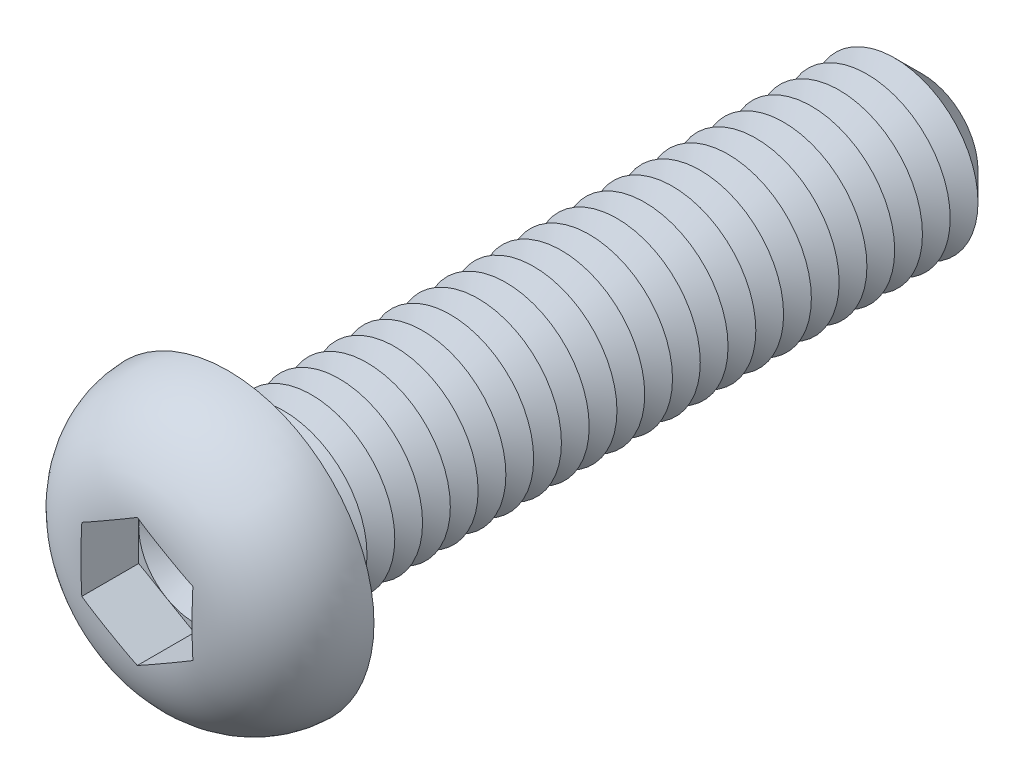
from build123d import *

# Parameters (mm, degrees)
CUT_EXTRUDE1_DEPTH  = 2.08
SKETCH4_R           = 3
BOSS_EXTRUDE1_DEPTH = 25
CHAMFER1_SIZE       = 1
LPATTERN1_COUNT     = 23
LPATTERN1_PITCH     = 1
FILLET2_R           = 0.5


with BuildPart() as part:
    # Sketch2 → Revolve1 (revolve)
    with BuildSketch(Plane(origin=(0, 0, 0), x_dir=(0, 0, -1), z_dir=(1, 0, 0)), mode=Mode.PRIVATE) as revolve1_sk:
        with BuildLine():
            Line((0, 0), (-3.3, 0))
            Line((-3.3, 0), (-3.3, 1.851470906))
            ThreePointArc((-3.3, 1.851470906), (-2.339262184, 4.220014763), (0, 5.25))
            Line((0, 5.25), (0, 0))
        make_face()
    revolve(revolve1_sk.sketch.rotate(Axis((0, 0, 47.934239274), (0, 0, -1)), 90), axis=Axis((0, 0, 47.934239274), (0, 0, -1)))

    # Sketch3 → Cut-Extrude1 (cut)
    with BuildSketch(Plane.XY.offset(3.3)):
        Polygon((0, 2.309401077), (-2, 1.154700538), (-2, -1.154700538), (0, -2.309401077), (2, -1.154700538), (2, 1.154700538), align=None)
    extrude(amount=-CUT_EXTRUDE1_DEPTH, mode=Mode.SUBTRACT)

    # Sketch4 → Boss-Extrude1 (add)
    with BuildSketch(Plane(origin=(0, 0, 0), x_dir=(-1, 0, 0), z_dir=(0, 0, -1))):
        Circle(SKETCH4_R)
    extrude(amount=BOSS_EXTRUDE1_DEPTH)

    # Chamfer1
    chamfer1_edges = [part.edges().sort_by_distance(p)[0] for p in [
        (3, 0, -25),
    ]]
    chamfer(chamfer1_edges, length=CHAMFER1_SIZE)

    # Sketch5 → Cut-Revolve1 (revolve, cut)
    with BuildSketch(Plane(origin=(0, 0, 0), x_dir=(0, 0, -1), z_dir=(1, 0, 0)), mode=Mode.PRIVATE) as cut_revolve1_sk:
        Polygon((1, 3), (2, 3), (1.5, 2.133974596), align=None)
    cut_revolve1 = revolve(cut_revolve1_sk.sketch.rotate(Axis((0, 0, 47.934239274), (0, 0, -1)), 90), axis=Axis((0, 0, 47.934239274), (0, 0, -1)), mode=Mode.SUBTRACT)

    # LPattern1: Cut-Revolve1 ×23
    with Locations(*[(0, 0, -i * LPATTERN1_PITCH) for i in range(1, LPATTERN1_COUNT)]):
        add(cut_revolve1, mode=Mode.SUBTRACT)

    # Fillet2
    fillet2_edges = [part.edges().sort_by_distance(p)[0] for p in [
        (3, 0, 0),
    ]]
    fillet(fillet2_edges, radius=FILLET2_R)

    # Cut-Extrude2 cone 1 section (on through the dimple's axis) → Cut-Extrude2 (revolve, cut)
    with BuildSketch(Plane(origin=(0, 0, 1.22), x_dir=(0, -1, 0), z_dir=(1, 0, 0))):
        Polygon((0, 0), (2, 0), (0, 1.154700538), align=None)
    revolve(axis=Axis((0, 0, 1.22), (0, 0, -1)), mode=Mode.SUBTRACT)


solid = part.part
